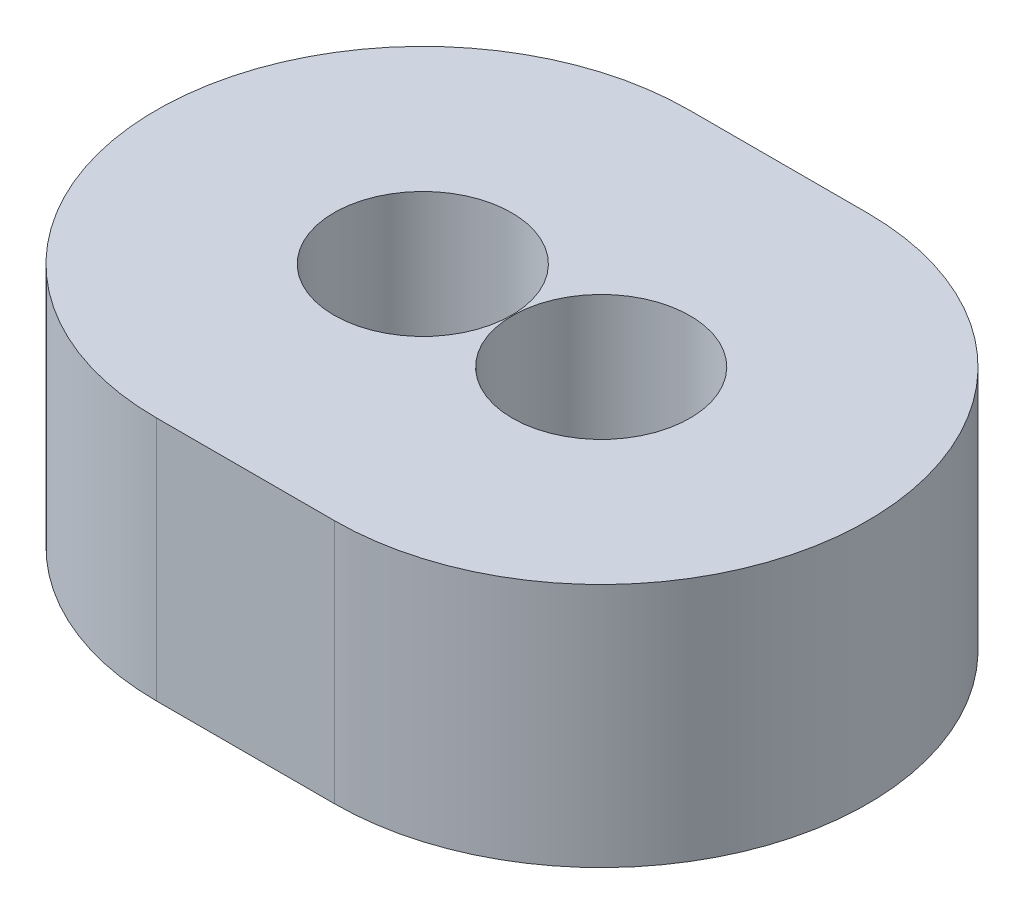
ISO-10303-21;
HEADER;
FILE_DESCRIPTION(('STEP AP214'),'2;1');
FILE_NAME('part.step','',(''),(''),'','','');
FILE_SCHEMA(('AUTOMOTIVE_DESIGN { 1 0 10303 214 1 1 1 1 }'));
ENDSEC;
DATA;
#1=APPLICATION_CONTEXT('core data for automotive mechanical design processes');
#2=APPLICATION_PROTOCOL_DEFINITION('international standard','automotive_design',2000,#1);
#3=PRODUCT_CONTEXT('',#1,'mechanical');
#4=PRODUCT('Part','Part','',(#3));
#5=PRODUCT_RELATED_PRODUCT_CATEGORY('part','',(#4));
#6=PRODUCT_DEFINITION_FORMATION('','',#4);
#7=PRODUCT_DEFINITION_CONTEXT('part definition',#1,'design');
#8=PRODUCT_DEFINITION('design','',#6,#7);
#9=PRODUCT_DEFINITION_SHAPE('','',#8);
#10=(LENGTH_UNIT() NAMED_UNIT(*) SI_UNIT(.MILLI.,.METRE.));
#11=(NAMED_UNIT(*) PLANE_ANGLE_UNIT() SI_UNIT($,.RADIAN.));
#12=(NAMED_UNIT(*) SI_UNIT($,.STERADIAN.) SOLID_ANGLE_UNIT());
#13=UNCERTAINTY_MEASURE_WITH_UNIT(LENGTH_MEASURE(1.E-05),#10,'distance_accuracy_value','');
#14=(GEOMETRIC_REPRESENTATION_CONTEXT(3) GLOBAL_UNCERTAINTY_ASSIGNED_CONTEXT((#13)) GLOBAL_UNIT_ASSIGNED_CONTEXT((#10,
#11,#12)) REPRESENTATION_CONTEXT('',''));
#15=CARTESIAN_POINT('',(0.,0.,0.));
#16=DIRECTION('',(0.,0.,1.));
#17=DIRECTION('',(1.,0.,0.));
#18=AXIS2_PLACEMENT_3D('',#15,#16,#17);
#19=CARTESIAN_POINT('',(-3.1877,8.763,0.));
#20=DIRECTION('',(0.,1.,0.));
#21=DIRECTION('',(0.,0.,1.));
#22=AXIS2_PLACEMENT_3D('',#19,#20,#21);
#23=PLANE('',#22);
#24=CARTESIAN_POINT('',(-3.1877,8.763,0.));
#25=DIRECTION('',(0.,1.,0.));
#26=DIRECTION('',(0.,0.,1.));
#27=AXIS2_PLACEMENT_3D('',#24,#25,#26);
#28=CIRCLE('',#27,3.175);
#29=CARTESIAN_POINT('',(-3.1877,8.763,3.175));
#30=VERTEX_POINT('',#29);
#31=EDGE_CURVE('E99',#30,#30,#28,.T.);
#32=ORIENTED_EDGE('',*,*,#31,.F.);
#33=EDGE_LOOP('',(#32));
#34=FACE_BOUND('',#33,.T.);
#35=CARTESIAN_POINT('',(-3.1877,8.763,0.));
#36=DIRECTION('',(0.,1.,0.));
#37=DIRECTION('',(0.,0.,1.));
#38=AXIS2_PLACEMENT_3D('',#35,#36,#37);
#39=CIRCLE('',#38,9.525);
#40=CARTESIAN_POINT('',(-3.1877,8.763,-9.525));
#41=VERTEX_POINT('',#40);
#42=CARTESIAN_POINT('',(-3.1877,8.763,9.525));
#43=VERTEX_POINT('',#42);
#44=EDGE_CURVE('E84',#41,#43,#39,.T.);
#45=ORIENTED_EDGE('',*,*,#44,.T.);
#46=DIRECTION('',(1.,0.,0.));
#47=VECTOR('',#46,1.);
#48=CARTESIAN_POINT('',(-3.1877,8.763,9.525));
#49=LINE('',#48,#47);
#50=CARTESIAN_POINT('',(3.1877,8.763,9.525));
#51=VERTEX_POINT('',#50);
#52=EDGE_CURVE('E79',#43,#51,#49,.T.);
#53=ORIENTED_EDGE('',*,*,#52,.T.);
#54=CARTESIAN_POINT('',(3.1877,8.763,0.));
#55=DIRECTION('',(0.,1.,0.));
#56=DIRECTION('',(0.,0.,1.));
#57=AXIS2_PLACEMENT_3D('',#54,#55,#56);
#58=CIRCLE('',#57,9.525);
#59=CARTESIAN_POINT('',(3.1877,8.763,-9.525));
#60=VERTEX_POINT('',#59);
#61=EDGE_CURVE('E82',#51,#60,#58,.T.);
#62=ORIENTED_EDGE('',*,*,#61,.T.);
#63=DIRECTION('',(-1.,0.,0.));
#64=VECTOR('',#63,1.);
#65=CARTESIAN_POINT('',(-3.1877,8.763,-9.525));
#66=LINE('',#65,#64);
#67=EDGE_CURVE('E49',#60,#41,#66,.T.);
#68=ORIENTED_EDGE('',*,*,#67,.T.);
#69=EDGE_LOOP('',(#45,#53,#62,#68));
#70=FACE_BOUND('',#69,.T.);
#71=CARTESIAN_POINT('',(3.1877,8.763,0.));
#72=DIRECTION('',(0.,1.,0.));
#73=DIRECTION('',(0.,0.,1.));
#74=AXIS2_PLACEMENT_3D('',#71,#72,#73);
#75=CIRCLE('',#74,3.175);
#76=CARTESIAN_POINT('',(3.1877,8.763,3.175));
#77=VERTEX_POINT('',#76);
#78=EDGE_CURVE('E114',#77,#77,#75,.T.);
#79=ORIENTED_EDGE('',*,*,#78,.F.);
#80=EDGE_LOOP('',(#79));
#81=FACE_BOUND('',#80,.T.);
#82=ADVANCED_FACE('F32',(#34,#70,#81),#23,.T.);
#83=CARTESIAN_POINT('',(-3.1877,0.,0.));
#84=DIRECTION('',(0.,1.,0.));
#85=DIRECTION('',(0.,0.,1.));
#86=AXIS2_PLACEMENT_3D('',#83,#84,#85);
#87=PLANE('',#86);
#88=CARTESIAN_POINT('',(-3.1877,0.,0.));
#89=DIRECTION('',(0.,1.,0.));
#90=DIRECTION('',(0.,0.,1.));
#91=AXIS2_PLACEMENT_3D('',#88,#89,#90);
#92=CIRCLE('',#91,3.175);
#93=CARTESIAN_POINT('',(-3.1877,0.,3.175));
#94=VERTEX_POINT('',#93);
#95=EDGE_CURVE('E111',#94,#94,#92,.T.);
#96=ORIENTED_EDGE('',*,*,#95,.T.);
#97=EDGE_LOOP('',(#96));
#98=FACE_BOUND('',#97,.T.);
#99=CARTESIAN_POINT('',(-3.1877,0.,0.));
#100=DIRECTION('',(0.,1.,0.));
#101=DIRECTION('',(0.,0.,1.));
#102=AXIS2_PLACEMENT_3D('',#99,#100,#101);
#103=CIRCLE('',#102,9.525);
#104=CARTESIAN_POINT('',(-3.1877,0.,-9.525));
#105=VERTEX_POINT('',#104);
#106=CARTESIAN_POINT('',(-3.1877,0.,9.525));
#107=VERTEX_POINT('',#106);
#108=EDGE_CURVE('E96',#105,#107,#103,.T.);
#109=ORIENTED_EDGE('',*,*,#108,.F.);
#110=DIRECTION('',(-1.,0.,0.));
#111=VECTOR('',#110,1.);
#112=CARTESIAN_POINT('',(-3.1877,0.,-9.525));
#113=LINE('',#112,#111);
#114=CARTESIAN_POINT('',(3.1877,0.,-9.525));
#115=VERTEX_POINT('',#114);
#116=EDGE_CURVE('E72',#115,#105,#113,.T.);
#117=ORIENTED_EDGE('',*,*,#116,.F.);
#118=CARTESIAN_POINT('',(3.1877,0.,0.));
#119=DIRECTION('',(0.,1.,0.));
#120=DIRECTION('',(0.,0.,1.));
#121=AXIS2_PLACEMENT_3D('',#118,#119,#120);
#122=CIRCLE('',#121,9.525);
#123=CARTESIAN_POINT('',(3.1877,0.,9.525));
#124=VERTEX_POINT('',#123);
#125=EDGE_CURVE('E66',#124,#115,#122,.T.);
#126=ORIENTED_EDGE('',*,*,#125,.F.);
#127=DIRECTION('',(1.,0.,0.));
#128=VECTOR('',#127,1.);
#129=CARTESIAN_POINT('',(-3.1877,0.,9.525));
#130=LINE('',#129,#128);
#131=EDGE_CURVE('E88',#107,#124,#130,.T.);
#132=ORIENTED_EDGE('',*,*,#131,.F.);
#133=EDGE_LOOP('',(#109,#117,#126,#132));
#134=FACE_BOUND('',#133,.T.);
#135=CARTESIAN_POINT('',(3.1877,0.,0.));
#136=DIRECTION('',(0.,1.,0.));
#137=DIRECTION('',(0.,0.,1.));
#138=AXIS2_PLACEMENT_3D('',#135,#136,#137);
#139=CIRCLE('',#138,3.175);
#140=CARTESIAN_POINT('',(3.1877,0.,3.175));
#141=VERTEX_POINT('',#140);
#142=EDGE_CURVE('E117',#141,#141,#139,.T.);
#143=ORIENTED_EDGE('',*,*,#142,.T.);
#144=EDGE_LOOP('',(#143));
#145=FACE_BOUND('',#144,.T.);
#146=ADVANCED_FACE('F107',(#98,#134,#145),#87,.F.);
#147=CARTESIAN_POINT('',(-3.1877,8.763,0.));
#148=DIRECTION('',(0.,-1.,0.));
#149=DIRECTION('',(0.,0.,-1.));
#150=AXIS2_PLACEMENT_3D('',#147,#148,#149);
#151=CYLINDRICAL_SURFACE('',#150,9.525);
#152=ORIENTED_EDGE('',*,*,#108,.T.);
#153=DIRECTION('',(0.,-1.,0.));
#154=VECTOR('',#153,1.);
#155=CARTESIAN_POINT('',(-3.1877,8.763,9.525));
#156=LINE('',#155,#154);
#157=EDGE_CURVE('E11',#43,#107,#156,.T.);
#158=ORIENTED_EDGE('',*,*,#157,.F.);
#159=ORIENTED_EDGE('',*,*,#44,.F.);
#160=DIRECTION('',(0.,-1.,0.));
#161=VECTOR('',#160,1.);
#162=CARTESIAN_POINT('',(-3.1877,8.763,-9.525));
#163=LINE('',#162,#161);
#164=EDGE_CURVE('E92',#41,#105,#163,.T.);
#165=ORIENTED_EDGE('',*,*,#164,.T.);
#166=EDGE_LOOP('',(#152,#158,#159,#165));
#167=FACE_BOUND('',#166,.T.);
#168=ADVANCED_FACE('F34',(#167),#151,.T.);
#169=CARTESIAN_POINT('',(-3.1877,8.763,9.525));
#170=DIRECTION('',(0.,0.,-1.));
#171=DIRECTION('',(-1.,0.,0.));
#172=AXIS2_PLACEMENT_3D('',#169,#170,#171);
#173=PLANE('',#172);
#174=ORIENTED_EDGE('',*,*,#131,.T.);
#175=DIRECTION('',(0.,-1.,0.));
#176=VECTOR('',#175,1.);
#177=CARTESIAN_POINT('',(3.1877,8.763,9.525));
#178=LINE('',#177,#176);
#179=EDGE_CURVE('E41',#51,#124,#178,.T.);
#180=ORIENTED_EDGE('',*,*,#179,.F.);
#181=ORIENTED_EDGE('',*,*,#52,.F.);
#182=ORIENTED_EDGE('',*,*,#157,.T.);
#183=EDGE_LOOP('',(#174,#180,#181,#182));
#184=FACE_BOUND('',#183,.T.);
#185=ADVANCED_FACE('F87',(#184),#173,.F.);
#186=CARTESIAN_POINT('',(3.1877,8.763,0.));
#187=DIRECTION('',(0.,-1.,0.));
#188=DIRECTION('',(0.,0.,-1.));
#189=AXIS2_PLACEMENT_3D('',#186,#187,#188);
#190=CYLINDRICAL_SURFACE('',#189,9.525);
#191=ORIENTED_EDGE('',*,*,#125,.T.);
#192=DIRECTION('',(0.,-1.,0.));
#193=VECTOR('',#192,1.);
#194=CARTESIAN_POINT('',(3.1877,8.763,-9.525));
#195=LINE('',#194,#193);
#196=EDGE_CURVE('E89',#60,#115,#195,.T.);
#197=ORIENTED_EDGE('',*,*,#196,.F.);
#198=ORIENTED_EDGE('',*,*,#61,.F.);
#199=ORIENTED_EDGE('',*,*,#179,.T.);
#200=EDGE_LOOP('',(#191,#197,#198,#199));
#201=FACE_BOUND('',#200,.T.);
#202=ADVANCED_FACE('F90',(#201),#190,.T.);
#203=CARTESIAN_POINT('',(-3.1877,8.763,-9.525));
#204=DIRECTION('',(0.,0.,1.));
#205=DIRECTION('',(1.,0.,0.));
#206=AXIS2_PLACEMENT_3D('',#203,#204,#205);
#207=PLANE('',#206);
#208=ORIENTED_EDGE('',*,*,#116,.T.);
#209=ORIENTED_EDGE('',*,*,#164,.F.);
#210=ORIENTED_EDGE('',*,*,#67,.F.);
#211=ORIENTED_EDGE('',*,*,#196,.T.);
#212=EDGE_LOOP('',(#208,#209,#210,#211));
#213=FACE_BOUND('',#212,.T.);
#214=ADVANCED_FACE('F104',(#213),#207,.F.);
#215=CARTESIAN_POINT('',(-3.1877,8.763,0.));
#216=DIRECTION('',(0.,-1.,0.));
#217=DIRECTION('',(0.,0.,-1.));
#218=AXIS2_PLACEMENT_3D('',#215,#216,#217);
#219=CYLINDRICAL_SURFACE('',#218,3.175);
#220=ORIENTED_EDGE('',*,*,#31,.T.);
#221=EDGE_LOOP('',(#220));
#222=FACE_BOUND('',#221,.T.);
#223=ORIENTED_EDGE('',*,*,#95,.F.);
#224=EDGE_LOOP('',(#223));
#225=FACE_BOUND('',#224,.T.);
#226=ADVANCED_FACE('F135',(#222,#225),#219,.F.);
#227=CARTESIAN_POINT('',(3.1877,8.763,0.));
#228=DIRECTION('',(0.,-1.,0.));
#229=DIRECTION('',(0.,0.,-1.));
#230=AXIS2_PLACEMENT_3D('',#227,#228,#229);
#231=CYLINDRICAL_SURFACE('',#230,3.175);
#232=ORIENTED_EDGE('',*,*,#78,.T.);
#233=EDGE_LOOP('',(#232));
#234=FACE_BOUND('',#233,.T.);
#235=ORIENTED_EDGE('',*,*,#142,.F.);
#236=EDGE_LOOP('',(#235));
#237=FACE_BOUND('',#236,.T.);
#238=ADVANCED_FACE('F123',(#234,#237),#231,.F.);
#239=CLOSED_SHELL('',(#82,#146,#168,#185,#202,#214,#226,#238));
#240=MANIFOLD_SOLID_BREP('B2',#239);
#241=ADVANCED_BREP_SHAPE_REPRESENTATION('',(#18,#240),#14);
#242=SHAPE_DEFINITION_REPRESENTATION(#9,#241);
ENDSEC;
END-ISO-10303-21;
